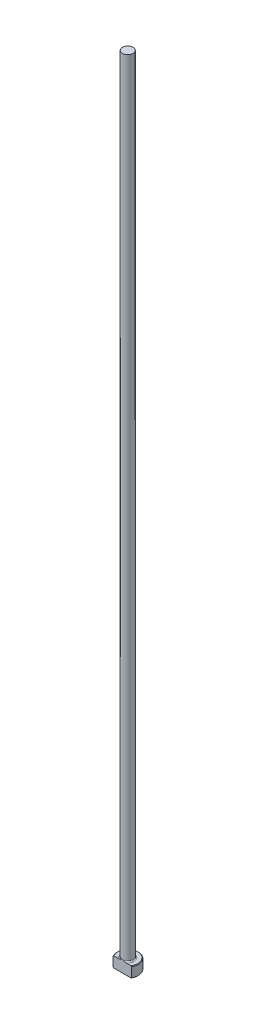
ISO-10303-21;
HEADER;
FILE_DESCRIPTION(('STEP AP214'),'2;1');
FILE_NAME('part.step','',(''),(''),'','','');
FILE_SCHEMA(('AUTOMOTIVE_DESIGN { 1 0 10303 214 1 1 1 1 }'));
ENDSEC;
DATA;
#1=APPLICATION_CONTEXT('core data for automotive mechanical design processes');
#2=APPLICATION_PROTOCOL_DEFINITION('international standard','automotive_design',2000,#1);
#3=PRODUCT_CONTEXT('',#1,'mechanical');
#4=PRODUCT('Part','Part','',(#3));
#5=PRODUCT_RELATED_PRODUCT_CATEGORY('part','',(#4));
#6=PRODUCT_DEFINITION_FORMATION('','',#4);
#7=PRODUCT_DEFINITION_CONTEXT('part definition',#1,'design');
#8=PRODUCT_DEFINITION('design','',#6,#7);
#9=PRODUCT_DEFINITION_SHAPE('','',#8);
#10=(LENGTH_UNIT() NAMED_UNIT(*) SI_UNIT(.MILLI.,.METRE.));
#11=(NAMED_UNIT(*) PLANE_ANGLE_UNIT() SI_UNIT($,.RADIAN.));
#12=(NAMED_UNIT(*) SI_UNIT($,.STERADIAN.) SOLID_ANGLE_UNIT());
#13=UNCERTAINTY_MEASURE_WITH_UNIT(LENGTH_MEASURE(1.E-05),#10,'distance_accuracy_value','');
#14=(GEOMETRIC_REPRESENTATION_CONTEXT(3) GLOBAL_UNCERTAINTY_ASSIGNED_CONTEXT((#13)) GLOBAL_UNIT_ASSIGNED_CONTEXT((#10,
#11,#12)) REPRESENTATION_CONTEXT('',''));
#15=CARTESIAN_POINT('',(0.,0.,0.));
#16=DIRECTION('',(0.,0.,1.));
#17=DIRECTION('',(1.,0.,0.));
#18=AXIS2_PLACEMENT_3D('',#15,#16,#17);
#19=CARTESIAN_POINT('',(0.,0.,0.));
#20=DIRECTION('',(0.,-1.,0.));
#21=DIRECTION('',(0.,0.,-1.));
#22=AXIS2_PLACEMENT_3D('',#19,#20,#21);
#23=PLANE('',#22);
#24=DIRECTION('',(1.,0.,0.));
#25=VECTOR('',#24,1.);
#26=CARTESIAN_POINT('',(-4.12444598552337,0.,2.38124999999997));
#27=LINE('',#26,#25);
#28=CARTESIAN_POINT('',(-3.82834437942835,0.,2.38124999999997));
#29=VERTEX_POINT('',#28);
#30=CARTESIAN_POINT('',(3.82834437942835,0.,2.38124999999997));
#31=VERTEX_POINT('',#30);
#32=EDGE_CURVE('E92',#29,#31,#27,.T.);
#33=ORIENTED_EDGE('',*,*,#32,.F.);
#34=CARTESIAN_POINT('',(0.,0.,0.));
#35=DIRECTION('',(0.,-1.,0.));
#36=DIRECTION('',(0.,0.,-1.));
#37=AXIS2_PLACEMENT_3D('',#34,#35,#36);
#38=CIRCLE('',#37,4.50850000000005);
#39=EDGE_CURVE('E105',#29,#31,#38,.T.);
#40=ORIENTED_EDGE('',*,*,#39,.T.);
#41=EDGE_LOOP('',(#33,#40));
#42=FACE_BOUND('',#41,.T.);
#43=ADVANCED_FACE('F37',(#42),#23,.T.);
#44=CARTESIAN_POINT('',(0.,259.958771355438,0.));
#45=DIRECTION('',(0.,1.,0.));
#46=DIRECTION('',(0.,0.,1.));
#47=AXIS2_PLACEMENT_3D('',#44,#45,#46);
#48=CYLINDRICAL_SURFACE('',#47,4.76249999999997);
#49=DIRECTION('',(0.,-1.,0.));
#50=VECTOR('',#49,1.);
#51=CARTESIAN_POINT('',(-4.12444598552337,355.6,2.38124999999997));
#52=LINE('',#51,#50);
#53=CARTESIAN_POINT('',(-4.12444598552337,4.49579999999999,2.38124999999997));
#54=VERTEX_POINT('',#53);
#55=CARTESIAN_POINT('',(-4.12444598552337,0.253999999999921,2.38124999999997));
#56=VERTEX_POINT('',#55);
#57=EDGE_CURVE('E95',#54,#56,#52,.T.);
#58=ORIENTED_EDGE('',*,*,#57,.F.);
#59=CARTESIAN_POINT('',(0.,4.49579999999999,0.));
#60=DIRECTION('',(0.,1.,0.));
#61=DIRECTION('',(0.,0.,1.));
#62=AXIS2_PLACEMENT_3D('',#59,#60,#61);
#63=CIRCLE('',#62,4.76249999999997);
#64=CARTESIAN_POINT('',(4.12444598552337,4.49579999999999,2.38124999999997));
#65=VERTEX_POINT('',#64);
#66=EDGE_CURVE('E109',#54,#65,#63,.F.);
#67=ORIENTED_EDGE('',*,*,#66,.T.);
#68=DIRECTION('',(0.,-1.,0.));
#69=VECTOR('',#68,1.);
#70=CARTESIAN_POINT('',(4.12444598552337,355.6,2.38124999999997));
#71=LINE('',#70,#69);
#72=CARTESIAN_POINT('',(4.12444598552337,0.253999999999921,2.38124999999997));
#73=VERTEX_POINT('',#72);
#74=EDGE_CURVE('E187',#65,#73,#71,.T.);
#75=ORIENTED_EDGE('',*,*,#74,.T.);
#76=CARTESIAN_POINT('',(0.,0.253999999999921,0.));
#77=DIRECTION('',(0.,-1.,0.));
#78=DIRECTION('',(0.,0.,-1.));
#79=AXIS2_PLACEMENT_3D('',#76,#77,#78);
#80=CIRCLE('',#79,4.76249999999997);
#81=EDGE_CURVE('E115',#73,#56,#80,.F.);
#82=ORIENTED_EDGE('',*,*,#81,.T.);
#83=EDGE_LOOP('',(#58,#67,#75,#82));
#84=FACE_BOUND('',#83,.T.);
#85=ADVANCED_FACE('F160',(#84),#48,.T.);
#86=CARTESIAN_POINT('',(-4.76249999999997,4.7498,0.));
#87=DIRECTION('',(0.,1.,0.));
#88=DIRECTION('',(0.,0.,1.));
#89=AXIS2_PLACEMENT_3D('',#86,#87,#88);
#90=PLANE('',#89);
#91=DIRECTION('',(-1.,0.,0.));
#92=VECTOR('',#91,1.);
#93=CARTESIAN_POINT('',(-4.76249999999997,4.7498,2.38124999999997));
#94=LINE('',#93,#92);
#95=CARTESIAN_POINT('',(3.82834437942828,4.7498,2.38124999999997));
#96=VERTEX_POINT('',#95);
#97=CARTESIAN_POINT('',(1.63628053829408,4.7498,2.38124999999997));
#98=VERTEX_POINT('',#97);
#99=EDGE_CURVE('E58',#96,#98,#94,.T.);
#100=ORIENTED_EDGE('',*,*,#99,.F.);
#101=CARTESIAN_POINT('',(0.,4.7498,0.));
#102=DIRECTION('',(0.,1.,0.));
#103=DIRECTION('',(0.,0.,1.));
#104=AXIS2_PLACEMENT_3D('',#101,#102,#103);
#105=CIRCLE('',#104,4.5085);
#106=CARTESIAN_POINT('',(-3.82834437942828,4.7498,2.38124999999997));
#107=VERTEX_POINT('',#106);
#108=EDGE_CURVE('E182',#96,#107,#105,.T.);
#109=ORIENTED_EDGE('',*,*,#108,.T.);
#110=CARTESIAN_POINT('',(-1.63628053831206,4.74979999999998,2.38124999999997));
#111=VERTEX_POINT('',#110);
#112=EDGE_CURVE('E140',#111,#107,#94,.T.);
#113=ORIENTED_EDGE('',*,*,#112,.F.);
#114=CARTESIAN_POINT('',(0.,4.7498,0.));
#115=DIRECTION('',(0.,1.,0.));
#116=DIRECTION('',(0.,0.,1.));
#117=AXIS2_PLACEMENT_3D('',#114,#115,#116);
#118=CIRCLE('',#117,2.88924999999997);
#119=EDGE_CURVE('E112',#111,#98,#118,.F.);
#120=ORIENTED_EDGE('',*,*,#119,.T.);
#121=EDGE_LOOP('',(#100,#109,#113,#120));
#122=FACE_BOUND('',#121,.T.);
#123=ADVANCED_FACE('F164',(#122),#90,.T.);
#124=CARTESIAN_POINT('',(0.,259.958771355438,0.));
#125=DIRECTION('',(0.,1.,0.));
#126=DIRECTION('',(0.,0.,1.));
#127=AXIS2_PLACEMENT_3D('',#124,#125,#126);
#128=CYLINDRICAL_SURFACE('',#127,2.38124999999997);
#129=CARTESIAN_POINT('',(0.,5.25779999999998,0.));
#130=DIRECTION('',(0.,1.,0.));
#131=DIRECTION('',(0.,0.,1.));
#132=AXIS2_PLACEMENT_3D('',#129,#130,#131);
#133=CIRCLE('',#132,2.38124999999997);
#134=CARTESIAN_POINT('',(0.,5.25779999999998,2.38124999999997));
#135=VERTEX_POINT('',#134);
#136=EDGE_CURVE('E108',#135,#135,#133,.T.);
#137=ORIENTED_EDGE('',*,*,#136,.T.);
#138=EDGE_LOOP('',(#137));
#139=FACE_BOUND('',#138,.T.);
#140=CARTESIAN_POINT('',(0.,355.6,0.));
#141=DIRECTION('',(0.,1.,0.));
#142=DIRECTION('',(0.,0.,1.));
#143=AXIS2_PLACEMENT_3D('',#140,#141,#142);
#144=CIRCLE('',#143,2.38124999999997);
#145=CARTESIAN_POINT('',(0.,355.6,2.38124999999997));
#146=VERTEX_POINT('',#145);
#147=EDGE_CURVE('E100',#146,#146,#144,.T.);
#148=ORIENTED_EDGE('',*,*,#147,.F.);
#149=EDGE_LOOP('',(#148));
#150=FACE_BOUND('',#149,.T.);
#151=ADVANCED_FACE('F169',(#139,#150),#128,.T.);
#152=CARTESIAN_POINT('',(-2.38124999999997,355.6,0.));
#153=DIRECTION('',(0.,1.,0.));
#154=DIRECTION('',(0.,0.,1.));
#155=AXIS2_PLACEMENT_3D('',#152,#153,#154);
#156=PLANE('',#155);
#157=ORIENTED_EDGE('',*,*,#147,.T.);
#158=EDGE_LOOP('',(#157));
#159=FACE_BOUND('',#158,.T.);
#160=ADVANCED_FACE('F127',(#159),#156,.T.);
#161=CARTESIAN_POINT('',(0.,4.74980000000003,0.));
#162=DIRECTION('',(0.,-1.,0.));
#163=DIRECTION('',(0.,0.,-1.));
#164=AXIS2_PLACEMENT_3D('',#161,#162,#163);
#165=CONICAL_SURFACE('',#164,4.50849999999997,0.78539816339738);
#166=CARTESIAN_POINT('',(4.12514598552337,4.49519376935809,2.38124999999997));
#167=CARTESIAN_POINT('',(4.00297518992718,4.60095936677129,2.38124999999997));
#168=CARTESIAN_POINT('',(3.88025631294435,4.70610504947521,2.38124999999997));
#169=CARTESIAN_POINT('',(3.63329815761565,4.91471466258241,2.38124999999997));
#170=CARTESIAN_POINT('',(3.50905817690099,5.01817776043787,2.38124999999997));
#171=CARTESIAN_POINT('',(3.25581608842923,5.22527725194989,2.38124999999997));
#172=CARTESIAN_POINT('',(3.12677062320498,5.32886083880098,2.38124999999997));
#173=CARTESIAN_POINT('',(2.86622698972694,5.53284356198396,2.38124999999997));
#174=CARTESIAN_POINT('',(2.73472944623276,5.63324349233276,2.38124999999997));
#175=CARTESIAN_POINT('',(2.4682888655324,5.82978962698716,2.38124999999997));
#176=CARTESIAN_POINT('',(2.3333412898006,5.92592971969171,2.38124999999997));
#177=CARTESIAN_POINT('',(2.05897760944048,6.11194575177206,2.38124999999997));
#178=CARTESIAN_POINT('',(1.91955795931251,6.20181653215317,2.38124999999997));
#179=CARTESIAN_POINT('',(1.63609152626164,6.37137961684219,2.38124999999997));
#180=CARTESIAN_POINT('',(1.49209041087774,6.4511472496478,2.38124999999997));
#181=CARTESIAN_POINT('',(1.19698803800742,6.59621615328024,2.38124999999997));
#182=CARTESIAN_POINT('',(1.04590060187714,6.66154427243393,2.38124999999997));
#183=CARTESIAN_POINT('',(0.811614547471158,6.74362759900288,2.38124999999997));
#184=CARTESIAN_POINT('',(0.731281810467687,6.76852601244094,2.38124999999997));
#185=CARTESIAN_POINT('',(0.568750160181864,6.8113251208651,2.38124999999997));
#186=CARTESIAN_POINT('',(0.48655154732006,6.82922693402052,2.38124999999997));
#187=CARTESIAN_POINT('',(0.32127205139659,6.85684671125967,2.38124999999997));
#188=CARTESIAN_POINT('',(0.238199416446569,6.86661311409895,2.38124999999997));
#189=CARTESIAN_POINT('',(0.0714834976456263,6.87742889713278,2.38124999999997));
#190=CARTESIAN_POINT('',(-0.0121597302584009,6.87847911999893,2.38124999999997));
#191=CARTESIAN_POINT('',(-0.179163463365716,6.87177943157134,2.38124999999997));
#192=CARTESIAN_POINT('',(-0.262523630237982,6.86402127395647,2.38124999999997));
#193=CARTESIAN_POINT('',(-0.428053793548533,6.84027123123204,2.38124999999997));
#194=CARTESIAN_POINT('',(-0.510223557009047,6.82427775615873,2.38124999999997));
#195=CARTESIAN_POINT('',(-0.673363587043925,6.78495183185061,2.38124999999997));
#196=CARTESIAN_POINT('',(-0.754321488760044,6.76156896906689,2.38124999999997));
#197=CARTESIAN_POINT('',(-0.914191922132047,6.70871125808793,2.38124999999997));
#198=CARTESIAN_POINT('',(-0.993104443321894,6.67923637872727,2.38124999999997));
#199=CARTESIAN_POINT('',(-1.16723389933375,6.60781445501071,2.38124999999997));
#200=CARTESIAN_POINT('',(-1.26191225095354,6.56456501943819,2.38124999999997));
#201=CARTESIAN_POINT('',(-1.44844363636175,6.47230549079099,2.38124999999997));
#202=CARTESIAN_POINT('',(-1.54029498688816,6.42329204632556,2.38124999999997));
#203=CARTESIAN_POINT('',(-1.72169646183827,6.32078732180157,2.38124999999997));
#204=CARTESIAN_POINT('',(-1.81124138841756,6.26728691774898,2.38124999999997));
#205=CARTESIAN_POINT('',(-1.98819821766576,6.15692869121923,2.38124999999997));
#206=CARTESIAN_POINT('',(-2.07561054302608,6.10007154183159,2.38124999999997));
#207=CARTESIAN_POINT('',(-2.24912105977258,5.98343359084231,2.38124999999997));
#208=CARTESIAN_POINT('',(-2.33520994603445,5.92363901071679,2.38124999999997));
#209=CARTESIAN_POINT('',(-2.50589894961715,5.80195652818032,2.38124999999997));
#210=CARTESIAN_POINT('',(-2.5904989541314,5.74006846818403,2.38124999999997));
#211=CARTESIAN_POINT('',(-2.842236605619,5.55206990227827,2.38124999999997));
#212=CARTESIAN_POINT('',(-3.00752130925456,5.42348112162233,2.38124999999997));
#213=CARTESIAN_POINT('',(-3.33377354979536,5.16258132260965,2.38124999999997));
#214=CARTESIAN_POINT('',(-3.4947581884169,5.03029147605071,2.38124999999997));
#215=CARTESIAN_POINT('',(-3.7334853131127,4.83027359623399,2.38124999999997));
#216=CARTESIAN_POINT('',(-3.81219356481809,4.76369334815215,2.38124999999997));
#217=CARTESIAN_POINT('',(-3.96906071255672,4.62989594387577,2.38124999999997));
#218=CARTESIAN_POINT('',(-4.04721963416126,4.56267881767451,2.38124999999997));
#219=CARTESIAN_POINT('',(-4.12514598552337,4.49519376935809,2.38124999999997));
#220=B_SPLINE_CURVE_WITH_KNOTS('',3,(#166,#167,#168,#169,#170,#171,#172,#173,#174,#175,#176,
#177,#178,#179,#180,#181,#182,#183,#184,#185,#186,#187,#188,#189,#190,#191,#192,#193,#194,#195,
#196,#197,#198,#199,#200,#201,#202,#203,#204,#205,#206,#207,#208,#209,#210,#211,#212,#213,#214,
#215,#216,#217,#218,#219),.UNSPECIFIED.,.F.,.F.,(4,2,2,2,2,2,2,2,2,2,2,2,2,2,2,2,2,2,2,2,2,2,2,
2,2,2,4),(0.,0.484787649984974,0.969808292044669,1.46620017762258,1.96246727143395,
2.45942471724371,2.9567863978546,3.45018895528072,3.94266623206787,4.19472143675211,
4.44673634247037,4.69723978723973,4.94771901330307,5.19843292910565,5.4491952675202,
5.70170675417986,5.95421953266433,6.26622041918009,6.57840361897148,6.89123777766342,
7.20400941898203,7.51842263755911,7.83285957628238,8.46097181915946,9.08602581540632,
9.39529830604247,9.70455630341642),.UNSPECIFIED.);
#221=EDGE_CURVE('E63',#65,#96,#220,.T.);
#222=ORIENTED_EDGE('',*,*,#221,.F.);
#223=ORIENTED_EDGE('',*,*,#66,.F.);
#224=EDGE_CURVE('E133',#107,#54,#220,.T.);
#225=ORIENTED_EDGE('',*,*,#224,.F.);
#226=ORIENTED_EDGE('',*,*,#108,.F.);
#227=EDGE_LOOP('',(#222,#223,#225,#226));
#228=FACE_BOUND('',#227,.T.);
#229=ADVANCED_FACE('F147',(#228),#165,.T.);
#230=CARTESIAN_POINT('',(0.,0.253999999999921,0.));
#231=DIRECTION('',(0.,1.,0.));
#232=DIRECTION('',(0.,0.,1.));
#233=AXIS2_PLACEMENT_3D('',#230,#231,#232);
#234=CONICAL_SURFACE('',#233,4.76249999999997,0.785398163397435);
#235=CARTESIAN_POINT('',(-4.12514598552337,0.254606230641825,2.38124999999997));
#236=CARTESIAN_POINT('',(-4.00297518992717,0.148840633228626,2.38124999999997));
#237=CARTESIAN_POINT('',(-3.88025631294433,0.0436949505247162,2.38124999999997));
#238=CARTESIAN_POINT('',(-3.63329815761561,-0.164914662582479,2.38124999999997));
#239=CARTESIAN_POINT('',(-3.50905817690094,-0.26837776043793,2.38124999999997));
#240=CARTESIAN_POINT('',(-3.25581608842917,-0.475477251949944,2.38124999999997));
#241=CARTESIAN_POINT('',(-3.12677062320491,-0.579060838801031,2.38124999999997));
#242=CARTESIAN_POINT('',(-2.86622698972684,-0.783043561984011,2.38124999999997));
#243=CARTESIAN_POINT('',(-2.73472944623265,-0.883443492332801,2.38124999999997));
#244=CARTESIAN_POINT('',(-2.46828886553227,-1.07998962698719,2.38124999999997));
#245=CARTESIAN_POINT('',(-2.33334128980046,-1.17612971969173,2.38124999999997));
#246=CARTESIAN_POINT('',(-2.05897760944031,-1.36214575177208,2.38124999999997));
#247=CARTESIAN_POINT('',(-1.91955795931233,-1.45201653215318,2.38124999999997));
#248=CARTESIAN_POINT('',(-1.63609152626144,-1.62157961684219,2.38124999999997));
#249=CARTESIAN_POINT('',(-1.49209041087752,-1.70134724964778,2.38124999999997));
#250=CARTESIAN_POINT('',(-1.19698803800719,-1.84641615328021,2.38124999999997));
#251=CARTESIAN_POINT('',(-1.04590060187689,-1.91174427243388,2.38124999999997));
#252=CARTESIAN_POINT('',(-0.811614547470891,-1.9938275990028,2.38124999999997));
#253=CARTESIAN_POINT('',(-0.731281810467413,-2.01872601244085,2.38124999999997));
#254=CARTESIAN_POINT('',(-0.568750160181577,-2.061525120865,2.38124999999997));
#255=CARTESIAN_POINT('',(-0.486551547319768,-2.07942693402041,2.38124999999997));
#256=CARTESIAN_POINT('',(-0.321272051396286,-2.10704671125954,2.38124999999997));
#257=CARTESIAN_POINT('',(-0.23819941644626,-2.11681311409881,2.38124999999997));
#258=CARTESIAN_POINT('',(-0.0714834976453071,-2.12762889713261,2.38124999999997));
#259=CARTESIAN_POINT('',(0.0121597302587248,-2.12867911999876,2.38124999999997));
#260=CARTESIAN_POINT('',(0.179163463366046,-2.12197943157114,2.38124999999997));
#261=CARTESIAN_POINT('',(0.262523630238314,-2.11422127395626,2.38124999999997));
#262=CARTESIAN_POINT('',(0.428053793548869,-2.09047123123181,2.38124999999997));
#263=CARTESIAN_POINT('',(0.510223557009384,-2.07447775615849,2.38124999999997));
#264=CARTESIAN_POINT('',(0.673363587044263,-2.03515183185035,2.38124999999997));
#265=CARTESIAN_POINT('',(0.754321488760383,-2.01176896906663,2.38124999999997));
#266=CARTESIAN_POINT('',(0.914191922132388,-1.95891125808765,2.38124999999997));
#267=CARTESIAN_POINT('',(0.993104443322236,-1.92943637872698,2.38124999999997));
#268=CARTESIAN_POINT('',(1.16723389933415,-1.85801445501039,2.38124999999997));
#269=CARTESIAN_POINT('',(1.26191225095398,-1.81476501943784,2.38124999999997));
#270=CARTESIAN_POINT('',(1.44844363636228,-1.72250549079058,2.38124999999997));
#271=CARTESIAN_POINT('',(1.54029498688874,-1.67349204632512,2.38124999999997));
#272=CARTESIAN_POINT('',(1.72169646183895,-1.57098732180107,2.38124999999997));
#273=CARTESIAN_POINT('',(1.81124138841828,-1.51748691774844,2.38124999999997));
#274=CARTESIAN_POINT('',(1.98819821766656,-1.40712869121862,2.38124999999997));
#275=CARTESIAN_POINT('',(2.07561054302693,-1.35027154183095,2.38124999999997));
#276=CARTESIAN_POINT('',(2.24912105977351,-1.23363359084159,2.38124999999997));
#277=CARTESIAN_POINT('',(2.33520994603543,-1.17383901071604,2.38124999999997));
#278=CARTESIAN_POINT('',(2.50589894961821,-1.05215652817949,2.38124999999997));
#279=CARTESIAN_POINT('',(2.59049895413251,-0.990268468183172,2.38124999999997));
#280=CARTESIAN_POINT('',(2.84223660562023,-0.802269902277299,2.38124999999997));
#281=CARTESIAN_POINT('',(3.00752130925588,-0.673681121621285,2.38124999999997));
#282=CARTESIAN_POINT('',(3.33377354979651,-0.412781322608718,2.38124999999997));
#283=CARTESIAN_POINT('',(3.49475818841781,-0.280491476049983,2.38124999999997));
#284=CARTESIAN_POINT('',(3.73348531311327,-0.0804735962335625,2.38124999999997));
#285=CARTESIAN_POINT('',(3.81219356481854,-0.0138933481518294,2.38124999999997));
#286=CARTESIAN_POINT('',(3.96906071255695,0.119904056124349,2.38124999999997));
#287=CARTESIAN_POINT('',(4.04721963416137,0.187121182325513,2.38124999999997));
#288=CARTESIAN_POINT('',(4.12514598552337,0.254606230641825,2.38124999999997));
#289=B_SPLINE_CURVE_WITH_KNOTS('',3,(#235,#236,#237,#238,#239,#240,#241,#242,#243,#244,#245,
#246,#247,#248,#249,#250,#251,#252,#253,#254,#255,#256,#257,#258,#259,#260,#261,#262,#263,#264,
#265,#266,#267,#268,#269,#270,#271,#272,#273,#274,#275,#276,#277,#278,#279,#280,#281,#282,#283,
#284,#285,#286,#287,#288),.UNSPECIFIED.,.F.,.F.,(4,2,2,2,2,2,2,2,2,2,2,2,2,2,2,2,2,2,2,2,2,2,2,
2,2,2,4),(0.,0.484787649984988,0.969808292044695,1.46620017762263,1.96246727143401,
2.4594247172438,2.95678639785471,3.45018895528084,3.942666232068,4.19472143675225,
4.44673634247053,4.6972397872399,4.94771901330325,5.19843292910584,5.4491952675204,
5.70170675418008,5.95421953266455,6.26622041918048,6.57840361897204,6.89123777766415,
7.20400941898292,7.51842263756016,7.8328595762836,8.46097181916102,9.08602581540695,
9.39529830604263,9.70455630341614),.UNSPECIFIED.);
#290=EDGE_CURVE('E89',#56,#29,#289,.T.);
#291=ORIENTED_EDGE('',*,*,#290,.F.);
#292=ORIENTED_EDGE('',*,*,#81,.F.);
#293=EDGE_CURVE('E101',#31,#73,#289,.T.);
#294=ORIENTED_EDGE('',*,*,#293,.F.);
#295=ORIENTED_EDGE('',*,*,#39,.F.);
#296=EDGE_LOOP('',(#291,#292,#294,#295));
#297=FACE_BOUND('',#296,.T.);
#298=ADVANCED_FACE('F107',(#297),#234,.T.);
#299=CARTESIAN_POINT('',(0.,5.25779999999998,0.));
#300=DIRECTION('',(0.,1.,0.));
#301=DIRECTION('',(0.,0.,1.));
#302=AXIS2_PLACEMENT_3D('',#299,#300,#301);
#303=TOROIDAL_SURFACE('',#302,2.88924999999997,0.508);
#304=ORIENTED_EDGE('',*,*,#119,.F.);
#305=CARTESIAN_POINT('',(0.,5.25779999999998,2.38124999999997));
#306=CARTESIAN_POINT('',(0.,5.25780082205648,2.38124999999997));
#307=CARTESIAN_POINT('',(-1.44246315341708E-07,5.25780164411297,2.38124999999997));
#308=CARTESIAN_POINT('',(-6.16936500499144E-07,5.25780323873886,2.38124999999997));
#309=CARTESIAN_POINT('',(-9.48586306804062E-07,5.25780401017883,2.38124999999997));
#310=CARTESIAN_POINT('',(-1.75082077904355E-06,5.25780554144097,2.38124999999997));
#311=CARTESIAN_POINT('',(-2.22915456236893E-06,5.25780629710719,2.38124999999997));
#312=CARTESIAN_POINT('',(-3.27181458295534E-06,5.25780773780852,2.38124999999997));
#313=CARTESIAN_POINT('',(-3.835676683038E-06,5.25780842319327,2.38124999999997));
#314=CARTESIAN_POINT('',(-5.8221973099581E-06,5.25781066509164,2.38124999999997));
#315=CARTESIAN_POINT('',(-7.35849850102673E-06,5.25781212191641,2.38124999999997));
#316=CARTESIAN_POINT('',(-1.05702998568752E-05,5.25781476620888,2.38124999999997));
#317=CARTESIAN_POINT('',(-1.22411084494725E-05,5.2578159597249,2.38124999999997));
#318=CARTESIAN_POINT('',(-1.86111247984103E-05,5.25782030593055,2.38124999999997));
#319=CARTESIAN_POINT('',(-2.34784761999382E-05,5.25782322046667,2.38124999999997));
#320=CARTESIAN_POINT('',(-3.31956636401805E-05,5.25782811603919,2.38124999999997));
#321=CARTESIAN_POINT('',(-3.80196285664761E-05,5.25783015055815,2.38124999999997));
#322=CARTESIAN_POINT('',(-5.813261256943E-05,5.25783854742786,2.38124999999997));
#323=CARTESIAN_POINT('',(-7.34799232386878E-05,5.25784474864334,2.38124999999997));
#324=CARTESIAN_POINT('',(-0.000102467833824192,5.25785494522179,2.38124999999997));
#325=CARTESIAN_POINT('',(-0.000116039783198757,5.25785912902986,2.38124999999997));
#326=CARTESIAN_POINT('',(-0.000212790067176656,5.25789158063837,2.38124999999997));
#327=CARTESIAN_POINT('',(-0.000291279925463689,5.2579320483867,2.38124999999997));
#328=CARTESIAN_POINT('',(-0.000593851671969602,5.25808218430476,2.38124999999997));
#329=CARTESIAN_POINT('',(-0.000821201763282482,5.25818279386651,2.38124999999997));
#330=CARTESIAN_POINT('',(-0.00169456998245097,5.25857522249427,2.38124999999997));
#331=CARTESIAN_POINT('',(-0.00233722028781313,5.25887652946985,2.38124999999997));
#332=CARTESIAN_POINT('',(-0.00493753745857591,5.26008964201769,2.38124999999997));
#333=CARTESIAN_POINT('',(-0.00689891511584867,5.26099082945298,2.38124999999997));
#334=CARTESIAN_POINT('',(-0.0508383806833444,5.281187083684,2.38124999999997));
#335=CARTESIAN_POINT('',(-0.0927708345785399,5.30061501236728,2.38124999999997));
#336=CARTESIAN_POINT('',(-0.17527482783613,5.33851044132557,2.38124999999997));
#337=CARTESIAN_POINT('',(-0.215842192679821,5.35698764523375,2.38124999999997));
#338=CARTESIAN_POINT('',(-0.301665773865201,5.39563561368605,2.38124999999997));
#339=CARTESIAN_POINT('',(-0.346940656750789,5.41576561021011,2.38124999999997));
#340=CARTESIAN_POINT('',(-0.438241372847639,5.45551278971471,2.38124999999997));
#341=CARTESIAN_POINT('',(-0.4842702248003,5.47512306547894,2.38124999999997));
#342=CARTESIAN_POINT('',(-0.565317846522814,5.50863652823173,2.38124999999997));
#343=CARTESIAN_POINT('',(-0.600248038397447,5.52275299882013,2.38124999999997));
#344=CARTESIAN_POINT('',(-0.670295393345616,5.55026700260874,2.38124999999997));
#345=CARTESIAN_POINT('',(-0.705411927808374,5.56366614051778,2.38124999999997));
#346=CARTESIAN_POINT('',(-0.809765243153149,5.60210810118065,2.38124999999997));
#347=CARTESIAN_POINT('',(-0.87943714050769,5.6259984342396,2.38124999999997));
#348=CARTESIAN_POINT('',(-0.996836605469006,5.66231043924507,2.38124999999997));
#349=CARTESIAN_POINT('',(-1.04419582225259,5.67591104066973,2.38124999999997));
#350=CARTESIAN_POINT('',(-1.13975994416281,5.70085221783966,2.38124999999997));
#351=CARTESIAN_POINT('',(-1.18796799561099,5.71218047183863,2.38124999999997));
#352=CARTESIAN_POINT('',(-1.33841293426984,5.74296860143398,2.38124999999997));
#353=CARTESIAN_POINT('',(-1.44177435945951,5.75767400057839,2.38124999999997));
#354=CARTESIAN_POINT('',(-1.60936912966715,5.76674980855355,2.38124999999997));
#355=CARTESIAN_POINT('',(-1.67328580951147,5.76678281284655,2.38124999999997));
#356=CARTESIAN_POINT('',(-1.79988036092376,5.75818170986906,2.38124999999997));
#357=CARTESIAN_POINT('',(-1.86256375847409,5.7496552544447,2.38124999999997));
#358=CARTESIAN_POINT('',(-1.9663105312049,5.72616398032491,2.38124999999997));
#359=CARTESIAN_POINT('',(-2.00801024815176,5.71404279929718,2.38124999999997));
#360=CARTESIAN_POINT('',(-2.08929854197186,5.6837572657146,2.38124999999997));
#361=CARTESIAN_POINT('',(-2.12888534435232,5.66558792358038,2.38124999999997));
#362=CARTESIAN_POINT('',(-2.19343451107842,5.62845715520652,2.38124999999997));
#363=CARTESIAN_POINT('',(-2.21936120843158,5.61118061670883,2.38124999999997));
#364=CARTESIAN_POINT('',(-2.26821976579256,5.57281353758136,2.38124999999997));
#365=CARTESIAN_POINT('',(-2.29115716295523,5.55173022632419,2.38124999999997));
#366=CARTESIAN_POINT('',(-2.3283351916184,5.51065246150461,2.38124999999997));
#367=CARTESIAN_POINT('',(-2.34338589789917,5.49139467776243,2.38124999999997));
#368=CARTESIAN_POINT('',(-2.37015797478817,5.45066634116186,2.38124999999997));
#369=CARTESIAN_POINT('',(-2.38188059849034,5.42919662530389,2.38124999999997));
#370=CARTESIAN_POINT('',(-2.40133155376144,5.38427591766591,2.38124999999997));
#371=CARTESIAN_POINT('',(-2.40902526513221,5.3608097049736,2.38124999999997));
#372=CARTESIAN_POINT('',(-2.4196333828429,5.31282025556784,2.38124999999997));
#373=CARTESIAN_POINT('',(-2.42255209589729,5.2882979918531,2.38124999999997));
#374=CARTESIAN_POINT('',(-2.42330579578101,5.24257134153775,2.38124999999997));
#375=CARTESIAN_POINT('',(-2.42178572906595,5.22137526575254,2.38124999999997));
#376=CARTESIAN_POINT('',(-2.41512107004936,5.17956667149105,2.38124999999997));
#377=CARTESIAN_POINT('',(-2.40997679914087,5.15895410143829,2.38124999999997));
#378=CARTESIAN_POINT('',(-2.39653123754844,5.11927433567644,2.38124999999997));
#379=CARTESIAN_POINT('',(-2.38829719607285,5.10018404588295,2.38124999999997));
#380=CARTESIAN_POINT('',(-2.36909923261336,5.06344104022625,2.38124999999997));
#381=CARTESIAN_POINT('',(-2.35813436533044,5.04578882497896,2.38124999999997));
#382=CARTESIAN_POINT('',(-2.3290070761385,5.00527867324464,2.38124999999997));
#383=CARTESIAN_POINT('',(-2.30973049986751,4.98322039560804,2.38124999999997));
#384=CARTESIAN_POINT('',(-2.26785259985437,4.94251014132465,2.38124999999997));
#385=CARTESIAN_POINT('',(-2.24524341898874,4.92386645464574,2.38124999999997));
#386=CARTESIAN_POINT('',(-2.18797490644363,4.88297636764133,2.38124999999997));
#387=CARTESIAN_POINT('',(-2.15215873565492,4.86235631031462,2.38124999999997));
#388=CARTESIAN_POINT('',(-2.07784819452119,4.82703601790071,2.38124999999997));
#389=CARTESIAN_POINT('',(-2.03935503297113,4.812333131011,2.38124999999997));
#390=CARTESIAN_POINT('',(-1.9391704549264,4.78128020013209,2.38124999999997));
#391=CARTESIAN_POINT('',(-1.87638619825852,4.76848853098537,2.38124999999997));
#392=CARTESIAN_POINT('',(-1.74894813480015,4.75239141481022,2.38124999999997));
#393=CARTESIAN_POINT('',(-1.68428057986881,4.74921386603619,2.38124999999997));
#394=CARTESIAN_POINT('',(-1.56080715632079,4.75049930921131,2.38124999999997));
#395=CARTESIAN_POINT('',(-1.50198901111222,4.75431101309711,2.38124999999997));
#396=CARTESIAN_POINT('',(-1.38480921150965,4.76709949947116,2.38124999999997));
#397=CARTESIAN_POINT('',(-1.32644892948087,4.77608822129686,2.38124999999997));
#398=CARTESIAN_POINT('',(-1.2135035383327,4.79766265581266,2.38124999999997));
#399=CARTESIAN_POINT('',(-1.15887777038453,4.81004137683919,2.38124999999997));
#400=CARTESIAN_POINT('',(-1.05073291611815,4.83776073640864,2.38124999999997));
#401=CARTESIAN_POINT('',(-0.997209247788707,4.85308377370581,2.38124999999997));
#402=CARTESIAN_POINT('',(-0.874272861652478,4.89132980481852,2.38124999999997));
#403=CARTESIAN_POINT('',(-0.805134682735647,4.91512993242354,2.38124999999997));
#404=CARTESIAN_POINT('',(-0.701560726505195,4.95339027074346,2.38124999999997));
#405=CARTESIAN_POINT('',(-0.666697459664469,4.96672252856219,2.38124999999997));
#406=CARTESIAN_POINT('',(-0.597152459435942,4.99408908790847,2.38124999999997));
#407=CARTESIAN_POINT('',(-0.562471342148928,5.00812495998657,2.38124999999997));
#408=CARTESIAN_POINT('',(-0.48190509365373,5.04147709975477,2.38124999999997));
#409=CARTESIAN_POINT('',(-0.436107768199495,5.06100454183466,2.38124999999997));
#410=CARTESIAN_POINT('',(-0.345263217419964,5.10057637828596,2.38124999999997));
#411=CARTESIAN_POINT('',(-0.300213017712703,5.12061397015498,2.38124999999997));
#412=CARTESIAN_POINT('',(-0.214815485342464,5.15907936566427,2.38124999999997));
#413=CARTESIAN_POINT('',(-0.174449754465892,5.17746700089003,2.38124999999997));
#414=CARTESIAN_POINT('',(-0.0923551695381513,5.21517676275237,2.38124999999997));
#415=CARTESIAN_POINT('',(-0.0506304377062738,5.23450847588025,2.38124999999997));
#416=CARTESIAN_POINT('',(-0.00689891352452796,5.25460917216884,2.38124999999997));
#417=CARTESIAN_POINT('',(-0.00493753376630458,5.25551035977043,2.38124999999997));
#418=CARTESIAN_POINT('',(-0.00233721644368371,5.25672347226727,2.38124999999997));
#419=CARTESIAN_POINT('',(-0.00169456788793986,5.25702477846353,2.38124999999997));
#420=CARTESIAN_POINT('',(-0.000821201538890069,5.25741720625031,2.38124999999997));
#421=CARTESIAN_POINT('',(-0.000593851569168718,5.25751781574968,2.38124999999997));
#422=CARTESIAN_POINT('',(-0.000291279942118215,5.25766795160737,2.38124999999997));
#423=CARTESIAN_POINT('',(-0.000212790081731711,5.25770841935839,2.38124999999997));
#424=CARTESIAN_POINT('',(-0.00011603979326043,5.25774087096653,2.38124999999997));
#425=CARTESIAN_POINT('',(-0.000102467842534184,5.25774505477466,2.38124999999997));
#426=CARTESIAN_POINT('',(-7.347992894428E-05,5.25775525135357,2.38124999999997));
#427=CARTESIAN_POINT('',(-5.81326166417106E-05,5.25776145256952,2.38124999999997));
#428=CARTESIAN_POINT('',(-3.80196306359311E-05,5.25776984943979,2.38124999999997));
#429=CARTESIAN_POINT('',(-3.31956653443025E-05,5.25777188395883,2.38124999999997));
#430=CARTESIAN_POINT('',(-2.34784771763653E-05,5.25777677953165,2.38124999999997));
#431=CARTESIAN_POINT('',(-1.86111254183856E-05,5.25777969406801,2.38124999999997));
#432=CARTESIAN_POINT('',(-1.2241108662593E-05,5.25778404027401,2.38124999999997));
#433=CARTESIAN_POINT('',(-1.05702999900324E-05,5.25778523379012,2.38124999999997));
#434=CARTESIAN_POINT('',(-7.35849849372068E-06,5.25778787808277,2.38124999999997));
#435=CARTESIAN_POINT('',(-5.82219724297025E-06,5.25778933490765,2.38124999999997));
#436=CARTESIAN_POINT('',(-3.83567656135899E-06,5.25779157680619,2.38124999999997));
#437=CARTESIAN_POINT('',(-3.27181445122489E-06,5.25779226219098,2.38124999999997));
#438=CARTESIAN_POINT('',(-2.22915442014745E-06,5.25779370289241,2.38124999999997));
#439=CARTESIAN_POINT('',(-1.75082063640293E-06,5.25779445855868,2.38124999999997));
#440=CARTESIAN_POINT('',(-9.48586177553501E-07,5.25779598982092,2.38124999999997));
#441=CARTESIAN_POINT('',(-6.16936383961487E-07,5.25779676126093,2.38124999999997));
#442=CARTESIAN_POINT('',(-1.44246242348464E-07,5.25779835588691,2.38124999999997));
#443=CARTESIAN_POINT('',(0.,5.25779917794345,2.38124999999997));
#444=CARTESIAN_POINT('',(0.,5.25779999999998,2.38124999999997));
#445=B_SPLINE_CURVE_WITH_KNOTS('',3,(#305,#306,#307,#308,#309,#310,#311,#312,#313,#314,#315,
#316,#317,#318,#319,#320,#321,#322,#323,#324,#325,#326,#327,#328,#329,#330,#331,#332,#333,#334,
#335,#336,#337,#338,#339,#340,#341,#342,#343,#344,#345,#346,#347,#348,#349,#350,#351,#352,#353,
#354,#355,#356,#357,#358,#359,#360,#361,#362,#363,#364,#365,#366,#367,#368,#369,#370,#371,#372,
#373,#374,#375,#376,#377,#378,#379,#380,#381,#382,#383,#384,#385,#386,#387,#388,#389,#390,#391,
#392,#393,#394,#395,#396,#397,#398,#399,#400,#401,#402,#403,#404,#405,#406,#407,#408,#409,#410,
#411,#412,#413,#414,#415,#416,#417,#418,#419,#420,#421,#422,#423,#424,#425,#426,#427,#428,#429,
#430,#431,#432,#433,#434,#435,#436,#437,#438,#439,#440,#441,#442,#443,#444),.UNSPECIFIED.,.T.,
.F.,(4,2,2,2,2,2,2,2,2,2,2,2,2,2,2,2,2,2,2,2,2,2,2,2,2,2,2,2,2,2,2,2,2,2,2,2,2,2,2,2,2,2,2,2,2,
2,2,2,2,2,2,2,2,2,2,2,2,2,2,2,2,2,2,2,2,2,2,2,2,4),(0.,2.46370364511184E-06,
4.97088840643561E-06,7.64418246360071E-06,1.03034566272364E-05,1.66236496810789E-05,
2.27785420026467E-05,3.9736495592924E-05,5.54272301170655E-05,0.000105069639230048,
0.000147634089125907,0.000411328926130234,0.00115816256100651,0.00328628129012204,
0.00976302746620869,0.148387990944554,0.282122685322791,0.430762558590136,0.58085063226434,
0.693868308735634,0.806621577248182,1.02747193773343,1.17523360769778,1.32377605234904,
1.63564503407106,1.8269819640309,2.01594223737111,2.14586868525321,2.27590258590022,
2.36907162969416,2.46206556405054,2.53511017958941,2.60812725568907,2.68176187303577,
2.75533004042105,2.81876340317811,2.88219114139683,2.94431167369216,3.00645373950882,
3.09384902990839,3.18145376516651,3.30474645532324,3.42798382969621,3.61914317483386,
3.81283460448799,3.98938468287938,4.16634356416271,4.3342710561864,4.5012242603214,
4.72047312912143,4.83244543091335,4.94467988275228,5.09403179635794,5.24194322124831,
5.37501604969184,5.51295433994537,5.51943109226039,5.52155920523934,5.52230603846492,
5.52256973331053,5.52261229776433,5.52266194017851,5.52267763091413,5.52269458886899,
5.52270074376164,5.52270706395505,5.52270972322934,5.52271239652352,5.52271490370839,
5.52271736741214),.UNSPECIFIED.);
#446=EDGE_CURVE('E11',#111,#135,#445,.T.);
#447=ORIENTED_EDGE('',*,*,#446,.T.);
#448=ORIENTED_EDGE('',*,*,#136,.F.);
#449=CARTESIAN_POINT('',(0.,5.25779999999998,2.38124999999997));
#450=CARTESIAN_POINT('',(0.,5.25779917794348,2.38124999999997));
#451=CARTESIAN_POINT('',(1.44246315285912E-07,5.25779835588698,2.38124999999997));
#452=CARTESIAN_POINT('',(6.16936500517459E-07,5.25779676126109,2.38124999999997));
#453=CARTESIAN_POINT('',(9.48586306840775E-07,5.25779598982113,2.38124999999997));
#454=CARTESIAN_POINT('',(1.75082077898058E-06,5.25779445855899,2.38124999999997));
#455=CARTESIAN_POINT('',(2.22915456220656E-06,5.25779370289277,2.38124999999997));
#456=CARTESIAN_POINT('',(3.27181458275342E-06,5.25779226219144,2.38124999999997));
#457=CARTESIAN_POINT('',(3.83567668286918E-06,5.25779157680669,2.38124999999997));
#458=CARTESIAN_POINT('',(5.82219730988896E-06,5.25778933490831,2.38124999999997));
#459=CARTESIAN_POINT('',(7.35849850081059E-06,5.25778787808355,2.38124999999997));
#460=CARTESIAN_POINT('',(1.05702998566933E-05,5.25778523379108,2.38124999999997));
#461=CARTESIAN_POINT('',(1.22411084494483E-05,5.25778404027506,2.38124999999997));
#462=CARTESIAN_POINT('',(1.86111247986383E-05,5.2577796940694,2.38124999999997));
#463=CARTESIAN_POINT('',(2.34784761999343E-05,5.25777677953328,2.38124999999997));
#464=CARTESIAN_POINT('',(3.31956636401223E-05,5.25777188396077,2.38124999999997));
#465=CARTESIAN_POINT('',(3.80196285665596E-05,5.25776984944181,2.38124999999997));
#466=CARTESIAN_POINT('',(5.81326125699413E-05,5.2577614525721,2.38124999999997));
#467=CARTESIAN_POINT('',(7.3479923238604E-05,5.25775525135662,2.38124999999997));
#468=CARTESIAN_POINT('',(0.00010246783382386,5.25774505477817,2.38124999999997));
#469=CARTESIAN_POINT('',(0.000116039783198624,5.2577408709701,2.38124999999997));
#470=CARTESIAN_POINT('',(0.000212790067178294,5.25770841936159,2.38124999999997));
#471=CARTESIAN_POINT('',(0.000291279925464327,5.25766795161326,2.38124999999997));
#472=CARTESIAN_POINT('',(0.000593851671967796,5.2575178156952,2.38124999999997));
#473=CARTESIAN_POINT('',(0.000821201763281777,5.25741720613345,2.38124999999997));
#474=CARTESIAN_POINT('',(0.00169456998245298,5.25702477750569,2.38124999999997));
#475=CARTESIAN_POINT('',(0.00233722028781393,5.25672347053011,2.38124999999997));
#476=CARTESIAN_POINT('',(0.00493753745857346,5.25551035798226,2.38124999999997));
#477=CARTESIAN_POINT('',(0.00689891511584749,5.25460917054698,2.38124999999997));
#478=CARTESIAN_POINT('',(0.0508383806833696,5.23441291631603,2.38124999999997));
#479=CARTESIAN_POINT('',(0.0927708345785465,5.2149849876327,2.38124999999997));
#480=CARTESIAN_POINT('',(0.175274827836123,5.17708955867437,2.38124999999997));
#481=CARTESIAN_POINT('',(0.215842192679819,5.15861235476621,2.38124999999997));
#482=CARTESIAN_POINT('',(0.301665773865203,5.11996438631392,2.38124999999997));
#483=CARTESIAN_POINT('',(0.346940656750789,5.09983438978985,2.38124999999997));
#484=CARTESIAN_POINT('',(0.438241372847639,5.06008721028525,2.38124999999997));
#485=CARTESIAN_POINT('',(0.484270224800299,5.04047693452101,2.38124999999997));
#486=CARTESIAN_POINT('',(0.565317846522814,5.00696347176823,2.38124999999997));
#487=CARTESIAN_POINT('',(0.600248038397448,4.99284700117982,2.38124999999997));
#488=CARTESIAN_POINT('',(0.670295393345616,4.96533299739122,2.38124999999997));
#489=CARTESIAN_POINT('',(0.705411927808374,4.95193385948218,2.38124999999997));
#490=CARTESIAN_POINT('',(0.809765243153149,4.9134918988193,2.38124999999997));
#491=CARTESIAN_POINT('',(0.87943714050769,4.88960156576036,2.38124999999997));
#492=CARTESIAN_POINT('',(0.996836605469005,4.85328956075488,2.38124999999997));
#493=CARTESIAN_POINT('',(1.04419582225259,4.83968895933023,2.38124999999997));
#494=CARTESIAN_POINT('',(1.13975994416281,4.8147477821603,2.38124999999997));
#495=CARTESIAN_POINT('',(1.18796799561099,4.80341952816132,2.38124999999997));
#496=CARTESIAN_POINT('',(1.33841293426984,4.77263139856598,2.38124999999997));
#497=CARTESIAN_POINT('',(1.44177435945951,4.75792599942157,2.38124999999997));
#498=CARTESIAN_POINT('',(1.60936912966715,4.74885019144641,2.38124999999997));
#499=CARTESIAN_POINT('',(1.67328580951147,4.74881718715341,2.38124999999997));
#500=CARTESIAN_POINT('',(1.79988036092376,4.7574182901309,2.38124999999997));
#501=CARTESIAN_POINT('',(1.86256375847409,4.76594474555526,2.38124999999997));
#502=CARTESIAN_POINT('',(1.9663105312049,4.78943601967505,2.38124999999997));
#503=CARTESIAN_POINT('',(2.00801024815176,4.80155720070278,2.38124999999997));
#504=CARTESIAN_POINT('',(2.08929854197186,4.83184273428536,2.38124999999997));
#505=CARTESIAN_POINT('',(2.12888534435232,4.85001207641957,2.38124999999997));
#506=CARTESIAN_POINT('',(2.19343451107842,4.88714284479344,2.38124999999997));
#507=CARTESIAN_POINT('',(2.21936120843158,4.90441938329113,2.38124999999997));
#508=CARTESIAN_POINT('',(2.26821976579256,4.9427864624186,2.38124999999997));
#509=CARTESIAN_POINT('',(2.29115716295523,4.96386977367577,2.38124999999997));
#510=CARTESIAN_POINT('',(2.3283351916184,5.00494753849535,2.38124999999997));
#511=CARTESIAN_POINT('',(2.34338589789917,5.02420532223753,2.38124999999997));
#512=CARTESIAN_POINT('',(2.37015797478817,5.0649336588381,2.38124999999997));
#513=CARTESIAN_POINT('',(2.38188059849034,5.08640337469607,2.38124999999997));
#514=CARTESIAN_POINT('',(2.40133155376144,5.13132408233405,2.38124999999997));
#515=CARTESIAN_POINT('',(2.40902526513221,5.15479029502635,2.38124999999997));
#516=CARTESIAN_POINT('',(2.4196333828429,5.20277974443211,2.38124999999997));
#517=CARTESIAN_POINT('',(2.42255209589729,5.22730200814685,2.38124999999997));
#518=CARTESIAN_POINT('',(2.42330579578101,5.27302865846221,2.38124999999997));
#519=CARTESIAN_POINT('',(2.42178572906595,5.29422473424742,2.38124999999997));
#520=CARTESIAN_POINT('',(2.41512107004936,5.33603332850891,2.38124999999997));
#521=CARTESIAN_POINT('',(2.40997679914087,5.35664589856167,2.38124999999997));
#522=CARTESIAN_POINT('',(2.39653123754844,5.39632566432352,2.38124999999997));
#523=CARTESIAN_POINT('',(2.38829719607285,5.41541595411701,2.38124999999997));
#524=CARTESIAN_POINT('',(2.36909923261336,5.45215895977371,2.38124999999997));
#525=CARTESIAN_POINT('',(2.35813436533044,5.469811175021,2.38124999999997));
#526=CARTESIAN_POINT('',(2.3290070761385,5.51032132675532,2.38124999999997));
#527=CARTESIAN_POINT('',(2.30973049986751,5.53237960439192,2.38124999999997));
#528=CARTESIAN_POINT('',(2.26785259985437,5.57308985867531,2.38124999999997));
#529=CARTESIAN_POINT('',(2.24524341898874,5.59173354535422,2.38124999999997));
#530=CARTESIAN_POINT('',(2.18797490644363,5.63262363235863,2.38124999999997));
#531=CARTESIAN_POINT('',(2.15215873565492,5.65324368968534,2.38124999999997));
#532=CARTESIAN_POINT('',(2.07784819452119,5.68856398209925,2.38124999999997));
#533=CARTESIAN_POINT('',(2.03935503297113,5.70326686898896,2.38124999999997));
#534=CARTESIAN_POINT('',(1.9391704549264,5.73431979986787,2.38124999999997));
#535=CARTESIAN_POINT('',(1.87638619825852,5.74711146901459,2.38124999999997));
#536=CARTESIAN_POINT('',(1.74894813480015,5.76320858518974,2.38124999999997));
#537=CARTESIAN_POINT('',(1.68428057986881,5.76638613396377,2.38124999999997));
#538=CARTESIAN_POINT('',(1.56080715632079,5.76510069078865,2.38124999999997));
#539=CARTESIAN_POINT('',(1.50198901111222,5.76128898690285,2.38124999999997));
#540=CARTESIAN_POINT('',(1.38480921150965,5.7485005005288,2.38124999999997));
#541=CARTESIAN_POINT('',(1.32644892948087,5.73951177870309,2.38124999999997));
#542=CARTESIAN_POINT('',(1.2135035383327,5.7179373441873,2.38124999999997));
#543=CARTESIAN_POINT('',(1.15887777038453,5.70555862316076,2.38124999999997));
#544=CARTESIAN_POINT('',(1.05073291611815,5.67783926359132,2.38124999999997));
#545=CARTESIAN_POINT('',(0.997209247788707,5.66251622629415,2.38124999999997));
#546=CARTESIAN_POINT('',(0.874272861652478,5.62427019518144,2.38124999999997));
#547=CARTESIAN_POINT('',(0.805134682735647,5.60047006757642,2.38124999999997));
#548=CARTESIAN_POINT('',(0.701560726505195,5.5622097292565,2.38124999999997));
#549=CARTESIAN_POINT('',(0.666697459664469,5.54887747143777,2.38124999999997));
#550=CARTESIAN_POINT('',(0.597152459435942,5.52151091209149,2.38124999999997));
#551=CARTESIAN_POINT('',(0.562471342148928,5.50747504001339,2.38124999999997));
#552=CARTESIAN_POINT('',(0.48190509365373,5.47412290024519,2.38124999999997));
#553=CARTESIAN_POINT('',(0.436107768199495,5.45459545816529,2.38124999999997));
#554=CARTESIAN_POINT('',(0.345263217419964,5.415023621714,2.38124999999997));
#555=CARTESIAN_POINT('',(0.300213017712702,5.39498602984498,2.38124999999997));
#556=CARTESIAN_POINT('',(0.214815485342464,5.35652063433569,2.38124999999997));
#557=CARTESIAN_POINT('',(0.174449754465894,5.33813299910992,2.38124999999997));
#558=CARTESIAN_POINT('',(0.0923551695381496,5.30042323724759,2.38124999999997));
#559=CARTESIAN_POINT('',(0.0506304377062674,5.28109152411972,2.38124999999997));
#560=CARTESIAN_POINT('',(0.00689891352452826,5.26099082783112,2.38124999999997));
#561=CARTESIAN_POINT('',(0.00493753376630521,5.26008964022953,2.38124999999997));
#562=CARTESIAN_POINT('',(0.0023372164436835,5.25887652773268,2.38124999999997));
#563=CARTESIAN_POINT('',(0.00169456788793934,5.25857522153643,2.38124999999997));
#564=CARTESIAN_POINT('',(0.000821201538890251,5.25818279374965,2.38124999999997));
#565=CARTESIAN_POINT('',(0.000593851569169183,5.25808218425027,2.38124999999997));
#566=CARTESIAN_POINT('',(0.000291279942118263,5.25793204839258,2.38124999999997));
#567=CARTESIAN_POINT('',(0.000212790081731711,5.25789158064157,2.38124999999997));
#568=CARTESIAN_POINT('',(0.000116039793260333,5.25785912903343,2.38124999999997));
#569=CARTESIAN_POINT('',(0.000102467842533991,5.2578549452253,2.38124999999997));
#570=CARTESIAN_POINT('',(7.34799289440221E-05,5.25784474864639,2.38124999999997));
#571=CARTESIAN_POINT('',(5.81326166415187E-05,5.25783854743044,2.38124999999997));
#572=CARTESIAN_POINT('',(3.80196306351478E-05,5.25783015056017,2.38124999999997));
#573=CARTESIAN_POINT('',(3.31956653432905E-05,5.25782811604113,2.38124999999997));
#574=CARTESIAN_POINT('',(2.34784771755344E-05,5.25782322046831,2.38124999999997));
#575=CARTESIAN_POINT('',(1.86111254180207E-05,5.25782030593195,2.38124999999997));
#576=CARTESIAN_POINT('',(1.22411086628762E-05,5.25781595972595,2.38124999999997));
#577=CARTESIAN_POINT('',(1.05702999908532E-05,5.25781476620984,2.38124999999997));
#578=CARTESIAN_POINT('',(7.35849849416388E-06,5.25781212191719,2.38124999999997));
#579=CARTESIAN_POINT('',(5.82219724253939E-06,5.25781066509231,2.38124999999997));
#580=CARTESIAN_POINT('',(3.83567656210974E-06,5.25780842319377,2.38124999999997));
#581=CARTESIAN_POINT('',(3.2718144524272E-06,5.25780773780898,2.38124999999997));
#582=CARTESIAN_POINT('',(2.22915442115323E-06,5.25780629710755,2.38124999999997));
#583=CARTESIAN_POINT('',(1.75082063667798E-06,5.25780554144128,2.38124999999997));
#584=CARTESIAN_POINT('',(9.48586177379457E-07,5.25780401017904,2.38124999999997));
#585=CARTESIAN_POINT('',(6.16936384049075E-07,5.25780323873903,2.38124999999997));
#586=CARTESIAN_POINT('',(1.44246242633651E-07,5.25780164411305,2.38124999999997));
#587=CARTESIAN_POINT('',(0.,5.25780082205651,2.38124999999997));
#588=CARTESIAN_POINT('',(0.,5.25779999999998,2.38124999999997));
#589=B_SPLINE_CURVE_WITH_KNOTS('',3,(#449,#450,#451,#452,#453,#454,#455,#456,#457,#458,#459,
#460,#461,#462,#463,#464,#465,#466,#467,#468,#469,#470,#471,#472,#473,#474,#475,#476,#477,#478,
#479,#480,#481,#482,#483,#484,#485,#486,#487,#488,#489,#490,#491,#492,#493,#494,#495,#496,#497,
#498,#499,#500,#501,#502,#503,#504,#505,#506,#507,#508,#509,#510,#511,#512,#513,#514,#515,#516,
#517,#518,#519,#520,#521,#522,#523,#524,#525,#526,#527,#528,#529,#530,#531,#532,#533,#534,#535,
#536,#537,#538,#539,#540,#541,#542,#543,#544,#545,#546,#547,#548,#549,#550,#551,#552,#553,#554,
#555,#556,#557,#558,#559,#560,#561,#562,#563,#564,#565,#566,#567,#568,#569,#570,#571,#572,#573,
#574,#575,#576,#577,#578,#579,#580,#581,#582,#583,#584,#585,#586,#587,#588),.UNSPECIFIED.,.T.,
.F.,(4,2,2,2,2,2,2,2,2,2,2,2,2,2,2,2,2,2,2,2,2,2,2,2,2,2,2,2,2,2,2,2,2,2,2,2,2,2,2,2,2,2,2,2,2,
2,2,2,2,2,2,2,2,2,2,2,2,2,2,2,2,2,2,2,2,2,2,2,2,4),(0.,2.46370364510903E-06,
4.97088840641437E-06,7.64418246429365E-06,1.03034566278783E-05,1.66236496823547E-05,
2.27785420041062E-05,3.97364955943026E-05,5.54272301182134E-05,0.000105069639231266,
0.000147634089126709,0.000411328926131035,0.00115816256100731,0.00328628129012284,
0.0097630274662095,0.148387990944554,0.282122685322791,0.430762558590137,0.58085063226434,
0.693868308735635,0.806621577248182,1.02747193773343,1.17523360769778,1.32377605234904,
1.63564503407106,1.8269819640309,2.01594223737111,2.14586868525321,2.27590258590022,
2.36907162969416,2.46206556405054,2.53511017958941,2.60812725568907,2.68176187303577,
2.75533004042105,2.81876340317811,2.88219114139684,2.94431167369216,3.00645373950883,
3.09384902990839,3.18145376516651,3.30474645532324,3.42798382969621,3.61914317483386,
3.81283460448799,3.98938468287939,4.16634356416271,4.3342710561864,4.5012242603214,
4.72047312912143,4.83244543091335,4.94467988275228,5.09403179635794,5.24194322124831,
5.37501604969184,5.51295433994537,5.51943109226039,5.52155920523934,5.52230603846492,
5.52256973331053,5.52261229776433,5.52266194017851,5.52267763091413,5.52269458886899,
5.52270074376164,5.52270706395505,5.52270972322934,5.52271239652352,5.52271490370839,
5.52271736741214),.UNSPECIFIED.);
#590=EDGE_CURVE('E51',#135,#98,#589,.T.);
#591=ORIENTED_EDGE('',*,*,#590,.T.);
#592=EDGE_LOOP('',(#304,#447,#448,#591));
#593=FACE_BOUND('',#592,.T.);
#594=ADVANCED_FACE('F39',(#593),#303,.F.);
#595=CARTESIAN_POINT('',(-4.12444598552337,355.6,2.38124999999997));
#596=DIRECTION('',(0.,0.,-1.));
#597=DIRECTION('',(-1.,0.,0.));
#598=AXIS2_PLACEMENT_3D('',#595,#596,#597);
#599=PLANE('',#598);
#600=ORIENTED_EDGE('',*,*,#290,.T.);
#601=ORIENTED_EDGE('',*,*,#32,.T.);
#602=ORIENTED_EDGE('',*,*,#293,.T.);
#603=ORIENTED_EDGE('',*,*,#74,.F.);
#604=ORIENTED_EDGE('',*,*,#221,.T.);
#605=ORIENTED_EDGE('',*,*,#99,.T.);
#606=ORIENTED_EDGE('',*,*,#590,.F.);
#607=ORIENTED_EDGE('',*,*,#446,.F.);
#608=ORIENTED_EDGE('',*,*,#112,.T.);
#609=ORIENTED_EDGE('',*,*,#224,.T.);
#610=ORIENTED_EDGE('',*,*,#57,.T.);
#611=EDGE_LOOP('',(#600,#601,#602,#603,#604,#605,#606,#607,#608,#609,#610));
#612=FACE_BOUND('',#611,.T.);
#613=ADVANCED_FACE('F91',(#612),#599,.F.);
#614=CLOSED_SHELL('',(#43,#85,#123,#151,#160,#229,#298,#594,#613));
#615=MANIFOLD_SOLID_BREP('B2',#614);
#616=ADVANCED_BREP_SHAPE_REPRESENTATION('',(#18,#615),#14);
#617=SHAPE_DEFINITION_REPRESENTATION(#9,#616);
ENDSEC;
END-ISO-10303-21;
